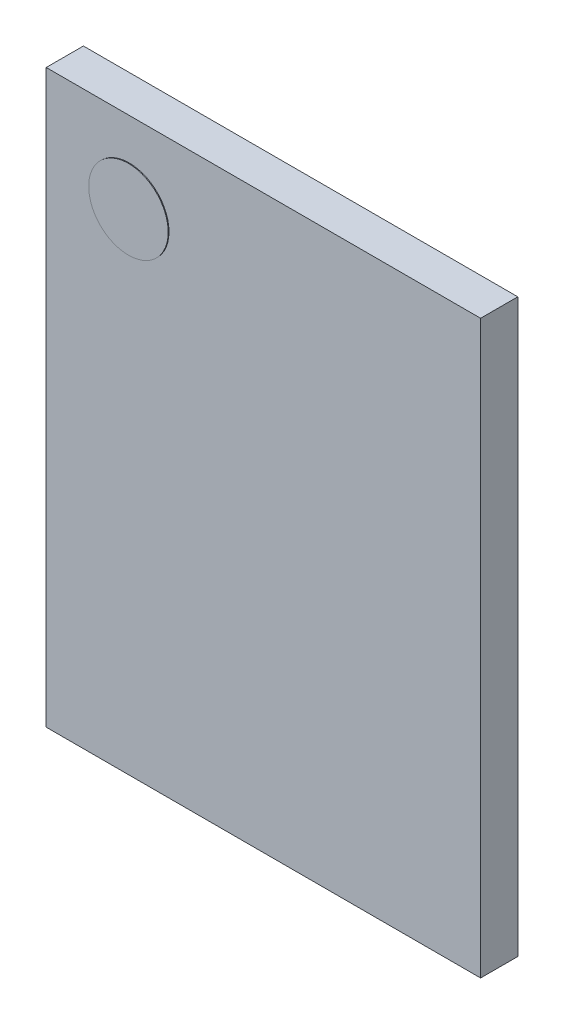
ISO-10303-21;
HEADER;
FILE_DESCRIPTION(('STEP AP214'),'2;1');
FILE_NAME('part.step','',(''),(''),'','','');
FILE_SCHEMA(('AUTOMOTIVE_DESIGN { 1 0 10303 214 1 1 1 1 }'));
ENDSEC;
DATA;
#1=APPLICATION_CONTEXT('core data for automotive mechanical design processes');
#2=APPLICATION_PROTOCOL_DEFINITION('international standard','automotive_design',2000,#1);
#3=PRODUCT_CONTEXT('',#1,'mechanical');
#4=PRODUCT('Part','Part','',(#3));
#5=PRODUCT_RELATED_PRODUCT_CATEGORY('part','',(#4));
#6=PRODUCT_DEFINITION_FORMATION('','',#4);
#7=PRODUCT_DEFINITION_CONTEXT('part definition',#1,'design');
#8=PRODUCT_DEFINITION('design','',#6,#7);
#9=PRODUCT_DEFINITION_SHAPE('','',#8);
#10=(LENGTH_UNIT() NAMED_UNIT(*) SI_UNIT(.MILLI.,.METRE.));
#11=(NAMED_UNIT(*) PLANE_ANGLE_UNIT() SI_UNIT($,.RADIAN.));
#12=(NAMED_UNIT(*) SI_UNIT($,.STERADIAN.) SOLID_ANGLE_UNIT());
#13=UNCERTAINTY_MEASURE_WITH_UNIT(LENGTH_MEASURE(1.E-05),#10,'distance_accuracy_value','');
#14=(GEOMETRIC_REPRESENTATION_CONTEXT(3) GLOBAL_UNCERTAINTY_ASSIGNED_CONTEXT((#13)) GLOBAL_UNIT_ASSIGNED_CONTEXT((#10,
#11,#12)) REPRESENTATION_CONTEXT('',''));
#15=CARTESIAN_POINT('',(0.,0.,0.));
#16=DIRECTION('',(0.,0.,1.));
#17=DIRECTION('',(1.,0.,0.));
#18=AXIS2_PLACEMENT_3D('',#15,#16,#17);
#19=CARTESIAN_POINT('',(5.54999906,-7.30000064,0.));
#20=DIRECTION('',(0.,-1.,0.));
#21=DIRECTION('',(-1.,0.,0.));
#22=AXIS2_PLACEMENT_3D('',#19,#20,#21);
#23=PLANE('',#22);
#24=DIRECTION('',(0.,0.,1.));
#25=VECTOR('',#24,1.);
#26=CARTESIAN_POINT('',(5.54999906,-7.30000064,0.));
#27=LINE('',#26,#25);
#28=CARTESIAN_POINT('',(5.54999906,-7.30000064,0.));
#29=VERTEX_POINT('',#28);
#30=CARTESIAN_POINT('',(5.54999906,-7.30000064,0.95000064));
#31=VERTEX_POINT('',#30);
#32=EDGE_CURVE('P0_E11',#29,#31,#27,.T.);
#33=ORIENTED_EDGE('',*,*,#32,.T.);
#34=DIRECTION('',(-1.,0.,0.));
#35=VECTOR('',#34,1.);
#36=CARTESIAN_POINT('',(5.54999906,-7.30000064,0.95000064));
#37=LINE('',#36,#35);
#38=CARTESIAN_POINT('',(-5.54999906,-7.30000064,0.95000064));
#39=VERTEX_POINT('',#38);
#40=EDGE_CURVE('P0_E24',#31,#39,#37,.T.);
#41=ORIENTED_EDGE('',*,*,#40,.T.);
#42=DIRECTION('',(0.,0.,1.));
#43=VECTOR('',#42,1.);
#44=CARTESIAN_POINT('',(-5.54999906,-7.30000064,0.));
#45=LINE('',#44,#43);
#46=CARTESIAN_POINT('',(-5.54999906,-7.30000064,0.));
#47=VERTEX_POINT('',#46);
#48=EDGE_CURVE('P0_E84',#47,#39,#45,.T.);
#49=ORIENTED_EDGE('',*,*,#48,.F.);
#50=DIRECTION('',(-1.,0.,0.));
#51=VECTOR('',#50,1.);
#52=CARTESIAN_POINT('',(5.54999906,-7.30000064,0.));
#53=LINE('',#52,#51);
#54=EDGE_CURVE('P0_E82',#29,#47,#53,.T.);
#55=ORIENTED_EDGE('',*,*,#54,.F.);
#56=EDGE_LOOP('',(#33,#41,#49,#55));
#57=FACE_BOUND('',#56,.T.);
#58=ADVANCED_FACE('P0_F17',(#57),#23,.T.);
#59=CARTESIAN_POINT('',(-5.54999906,-7.30000064,0.));
#60=DIRECTION('',(-1.,0.,0.));
#61=DIRECTION('',(0.,1.,0.));
#62=AXIS2_PLACEMENT_3D('',#59,#60,#61);
#63=PLANE('',#62);
#64=ORIENTED_EDGE('',*,*,#48,.T.);
#65=DIRECTION('',(0.,1.,0.));
#66=VECTOR('',#65,1.);
#67=CARTESIAN_POINT('',(-5.54999906,-7.30000064,0.95000064));
#68=LINE('',#67,#66);
#69=CARTESIAN_POINT('',(-5.54999906,7.30000064,0.95000064));
#70=VERTEX_POINT('',#69);
#71=EDGE_CURVE('P0_E79',#39,#70,#68,.T.);
#72=ORIENTED_EDGE('',*,*,#71,.T.);
#73=DIRECTION('',(0.,0.,1.));
#74=VECTOR('',#73,1.);
#75=CARTESIAN_POINT('',(-5.54999906,7.30000064,0.));
#76=LINE('',#75,#74);
#77=CARTESIAN_POINT('',(-5.54999906,7.30000064,0.));
#78=VERTEX_POINT('',#77);
#79=EDGE_CURVE('P0_E77',#78,#70,#76,.T.);
#80=ORIENTED_EDGE('',*,*,#79,.F.);
#81=DIRECTION('',(0.,1.,0.));
#82=VECTOR('',#81,1.);
#83=CARTESIAN_POINT('',(-5.54999906,-7.30000064,0.));
#84=LINE('',#83,#82);
#85=EDGE_CURVE('P0_E67',#47,#78,#84,.T.);
#86=ORIENTED_EDGE('',*,*,#85,.F.);
#87=EDGE_LOOP('',(#64,#72,#80,#86));
#88=FACE_BOUND('',#87,.T.);
#89=ADVANCED_FACE('P0_F90',(#88),#63,.T.);
#90=CARTESIAN_POINT('',(-5.54999906,7.30000064,0.));
#91=DIRECTION('',(0.,1.,0.));
#92=DIRECTION('',(1.,0.,0.));
#93=AXIS2_PLACEMENT_3D('',#90,#91,#92);
#94=PLANE('',#93);
#95=ORIENTED_EDGE('',*,*,#79,.T.);
#96=DIRECTION('',(1.,0.,0.));
#97=VECTOR('',#96,1.);
#98=CARTESIAN_POINT('',(-5.54999906,7.30000064,0.95000064));
#99=LINE('',#98,#97);
#100=CARTESIAN_POINT('',(5.54999906,7.30000064,0.95000064));
#101=VERTEX_POINT('',#100);
#102=EDGE_CURVE('P0_E59',#70,#101,#99,.T.);
#103=ORIENTED_EDGE('',*,*,#102,.T.);
#104=DIRECTION('',(0.,0.,1.));
#105=VECTOR('',#104,1.);
#106=CARTESIAN_POINT('',(5.54999906,7.30000064,0.));
#107=LINE('',#106,#105);
#108=CARTESIAN_POINT('',(5.54999906,7.30000064,0.));
#109=VERTEX_POINT('',#108);
#110=EDGE_CURVE('P0_E54',#109,#101,#107,.T.);
#111=ORIENTED_EDGE('',*,*,#110,.F.);
#112=DIRECTION('',(1.,0.,0.));
#113=VECTOR('',#112,1.);
#114=CARTESIAN_POINT('',(-5.54999906,7.30000064,0.));
#115=LINE('',#114,#113);
#116=EDGE_CURVE('P0_E58',#78,#109,#115,.T.);
#117=ORIENTED_EDGE('',*,*,#116,.F.);
#118=EDGE_LOOP('',(#95,#103,#111,#117));
#119=FACE_BOUND('',#118,.T.);
#120=ADVANCED_FACE('P0_F57',(#119),#94,.T.);
#121=CARTESIAN_POINT('',(5.54999906,7.30000064,0.));
#122=DIRECTION('',(1.,0.,0.));
#123=DIRECTION('',(0.,-1.,0.));
#124=AXIS2_PLACEMENT_3D('',#121,#122,#123);
#125=PLANE('',#124);
#126=ORIENTED_EDGE('',*,*,#110,.T.);
#127=DIRECTION('',(0.,-1.,0.));
#128=VECTOR('',#127,1.);
#129=CARTESIAN_POINT('',(5.54999906,7.30000064,0.95000064));
#130=LINE('',#129,#128);
#131=EDGE_CURVE('P0_E69',#101,#31,#130,.T.);
#132=ORIENTED_EDGE('',*,*,#131,.T.);
#133=ORIENTED_EDGE('',*,*,#32,.F.);
#134=DIRECTION('',(0.,-1.,0.));
#135=VECTOR('',#134,1.);
#136=CARTESIAN_POINT('',(5.54999906,7.30000064,0.));
#137=LINE('',#136,#135);
#138=EDGE_CURVE('P0_E66',#109,#29,#137,.T.);
#139=ORIENTED_EDGE('',*,*,#138,.F.);
#140=EDGE_LOOP('',(#126,#132,#133,#139));
#141=FACE_BOUND('',#140,.T.);
#142=ADVANCED_FACE('P0_F71',(#141),#125,.T.);
#143=CARTESIAN_POINT('',(5.54999906,-7.30000064,0.));
#144=DIRECTION('',(0.,0.,1.));
#145=DIRECTION('',(1.,0.,0.));
#146=AXIS2_PLACEMENT_3D('',#143,#144,#145);
#147=PLANE('',#146);
#148=ORIENTED_EDGE('',*,*,#54,.T.);
#149=ORIENTED_EDGE('',*,*,#85,.T.);
#150=ORIENTED_EDGE('',*,*,#116,.T.);
#151=ORIENTED_EDGE('',*,*,#138,.T.);
#152=EDGE_LOOP('',(#148,#149,#150,#151));
#153=FACE_BOUND('',#152,.T.);
#154=ADVANCED_FACE('P0_F65',(#153),#147,.F.);
#155=CARTESIAN_POINT('',(5.54999906,-7.30000064,0.95000064));
#156=DIRECTION('',(0.,0.,1.));
#157=DIRECTION('',(1.,0.,0.));
#158=AXIS2_PLACEMENT_3D('',#155,#156,#157);
#159=PLANE('',#158);
#160=ORIENTED_EDGE('',*,*,#131,.F.);
#161=ORIENTED_EDGE('',*,*,#102,.F.);
#162=ORIENTED_EDGE('',*,*,#71,.F.);
#163=ORIENTED_EDGE('',*,*,#40,.F.);
#164=EDGE_LOOP('',(#160,#161,#162,#163));
#165=FACE_BOUND('',#164,.T.);
#166=ADVANCED_FACE('P0_F91',(#165),#159,.T.);
#167=CLOSED_SHELL('',(#58,#89,#120,#142,#154,#166));
#168=MANIFOLD_SOLID_BREP('P0_B1',#167);
#169=CARTESIAN_POINT('',(-3.42888832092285,5.23248147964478,0.00999998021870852));
#170=DIRECTION('',(0.,0.,-1.));
#171=DIRECTION('',(0.999999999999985,1.74845553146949E-07,0.));
#172=AXIS2_PLACEMENT_3D('',#169,#170,#171);
#173=CYLINDRICAL_SURFACE('',#172,1.016);
#174=CARTESIAN_POINT('',(-3.42888832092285,5.23248147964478,0.00999998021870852));
#175=DIRECTION('',(0.,0.,1.));
#176=DIRECTION('',(0.999999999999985,1.74845553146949E-07,0.));
#177=AXIS2_PLACEMENT_3D('',#174,#175,#176);
#178=CIRCLE('',#177,1.016);
#179=CARTESIAN_POINT('',(-2.41288832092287,5.23248165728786,0.00999998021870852));
#180=VERTEX_POINT('',#179);
#181=EDGE_CURVE('P1_E11',#180,#180,#178,.T.);
#182=ORIENTED_EDGE('',*,*,#181,.T.);
#183=DIRECTION('',(0.,0.,1.));
#184=VECTOR('',#183,1.);
#185=CARTESIAN_POINT('',(-2.41288832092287,5.23248165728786,0.00999998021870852));
#186=LINE('',#185,#184);
#187=CARTESIAN_POINT('',(-2.41288832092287,5.23248165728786,0.970000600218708));
#188=VERTEX_POINT('',#187);
#189=EDGE_CURVE('P1_E24',#180,#188,#186,.T.);
#190=ORIENTED_EDGE('',*,*,#189,.T.);
#191=CARTESIAN_POINT('',(-3.42888832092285,5.23248147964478,0.970000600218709));
#192=DIRECTION('',(0.,0.,1.));
#193=DIRECTION('',(0.999999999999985,1.74845553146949E-07,0.));
#194=AXIS2_PLACEMENT_3D('',#191,#192,#193);
#195=CIRCLE('',#194,1.016);
#196=EDGE_CURVE('P1_E32',#188,#188,#195,.T.);
#197=ORIENTED_EDGE('',*,*,#196,.F.);
#198=ORIENTED_EDGE('',*,*,#189,.F.);
#199=EDGE_LOOP('',(#182,#190,#197,#198));
#200=FACE_BOUND('',#199,.T.);
#201=ADVANCED_FACE('P1_F17',(#200),#173,.T.);
#202=CARTESIAN_POINT('',(-2.41288832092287,5.23248165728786,0.00999998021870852));
#203=DIRECTION('',(0.,0.,-1.));
#204=DIRECTION('',(-0.999999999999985,-1.74845553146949E-07,0.));
#205=AXIS2_PLACEMENT_3D('',#202,#203,#204);
#206=PLANE('',#205);
#207=ORIENTED_EDGE('',*,*,#181,.F.);
#208=EDGE_LOOP('',(#207));
#209=FACE_BOUND('',#208,.T.);
#210=ADVANCED_FACE('P1_F37',(#209),#206,.T.);
#211=CARTESIAN_POINT('',(-2.41288832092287,5.23248165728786,0.970000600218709));
#212=DIRECTION('',(0.,0.,-1.));
#213=DIRECTION('',(-0.999999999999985,-1.74845553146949E-07,0.));
#214=AXIS2_PLACEMENT_3D('',#211,#212,#213);
#215=PLANE('',#214);
#216=ORIENTED_EDGE('',*,*,#196,.T.);
#217=EDGE_LOOP('',(#216));
#218=FACE_BOUND('',#217,.T.);
#219=ADVANCED_FACE('P1_F34',(#218),#215,.F.);
#220=CLOSED_SHELL('',(#201,#210,#219));
#221=MANIFOLD_SOLID_BREP('P1_B1',#220);
#222=ADVANCED_BREP_SHAPE_REPRESENTATION('',(#18,#168,#221),#14);
#223=SHAPE_DEFINITION_REPRESENTATION(#9,#222);
ENDSEC;
END-ISO-10303-21;
